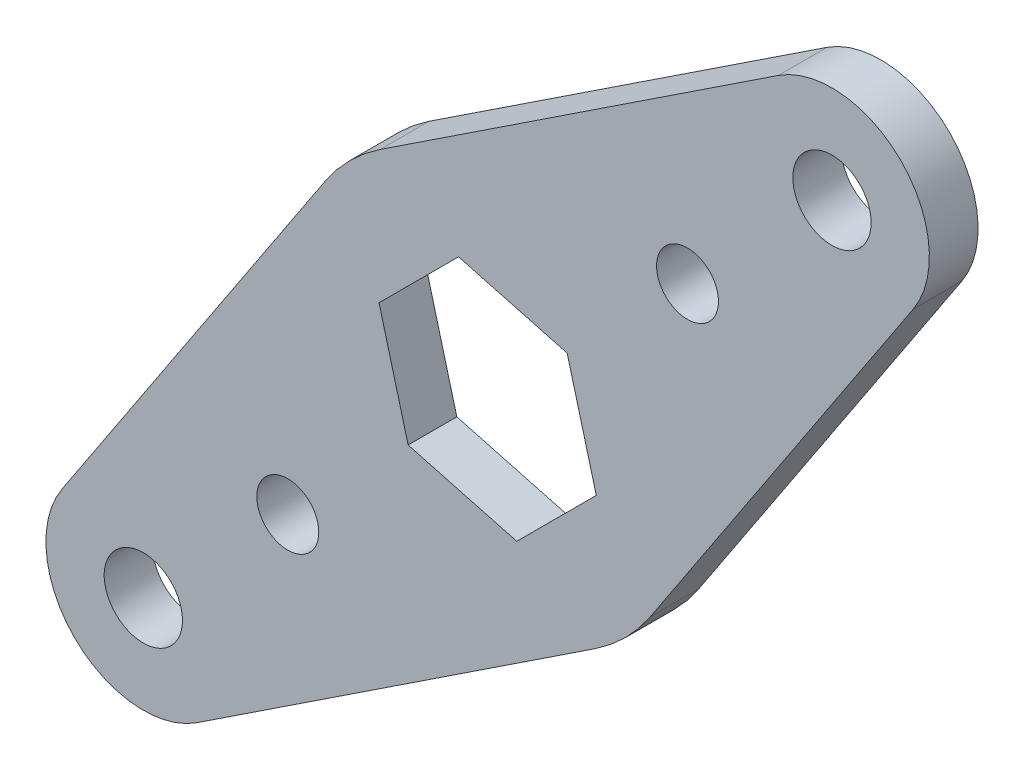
ISO-10303-21;
HEADER;
FILE_DESCRIPTION(('STEP AP214'),'2;1');
FILE_NAME('part.step','',(''),(''),'','','');
FILE_SCHEMA(('AUTOMOTIVE_DESIGN { 1 0 10303 214 1 1 1 1 }'));
ENDSEC;
DATA;
#1=APPLICATION_CONTEXT('core data for automotive mechanical design processes');
#2=APPLICATION_PROTOCOL_DEFINITION('international standard','automotive_design',2000,#1);
#3=PRODUCT_CONTEXT('',#1,'mechanical');
#4=PRODUCT('Part','Part','',(#3));
#5=PRODUCT_RELATED_PRODUCT_CATEGORY('part','',(#4));
#6=PRODUCT_DEFINITION_FORMATION('','',#4);
#7=PRODUCT_DEFINITION_CONTEXT('part definition',#1,'design');
#8=PRODUCT_DEFINITION('design','',#6,#7);
#9=PRODUCT_DEFINITION_SHAPE('','',#8);
#10=(LENGTH_UNIT() NAMED_UNIT(*) SI_UNIT(.MILLI.,.METRE.));
#11=(NAMED_UNIT(*) PLANE_ANGLE_UNIT() SI_UNIT($,.RADIAN.));
#12=(NAMED_UNIT(*) SI_UNIT($,.STERADIAN.) SOLID_ANGLE_UNIT());
#13=UNCERTAINTY_MEASURE_WITH_UNIT(LENGTH_MEASURE(1.E-05),#10,'distance_accuracy_value','');
#14=(GEOMETRIC_REPRESENTATION_CONTEXT(3) GLOBAL_UNCERTAINTY_ASSIGNED_CONTEXT((#13)) GLOBAL_UNIT_ASSIGNED_CONTEXT((#10,
#11,#12)) REPRESENTATION_CONTEXT('',''));
#15=CARTESIAN_POINT('',(0.,0.,0.));
#16=DIRECTION('',(0.,0.,1.));
#17=DIRECTION('',(1.,0.,0.));
#18=AXIS2_PLACEMENT_3D('',#15,#16,#17);
#19=CARTESIAN_POINT('',(0.,0.,3.175));
#20=DIRECTION('',(0.,0.,1.));
#21=DIRECTION('',(1.,0.,0.));
#22=AXIS2_PLACEMENT_3D('',#19,#20,#21);
#23=PLANE('',#22);
#24=CARTESIAN_POINT('',(-13.0303516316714,-13.0303516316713,3.175));
#25=DIRECTION('',(0.,0.,1.));
#26=DIRECTION('',(1.,0.,0.));
#27=AXIS2_PLACEMENT_3D('',#24,#25,#26);
#28=CIRCLE('',#27,2.0193);
#29=CARTESIAN_POINT('',(-11.0110516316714,-13.0303516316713,3.175));
#30=VERTEX_POINT('',#29);
#31=EDGE_CURVE('E191',#30,#30,#28,.T.);
#32=ORIENTED_EDGE('',*,*,#31,.F.);
#33=EDGE_LOOP('',(#32));
#34=FACE_BOUND('',#33,.T.);
#35=CARTESIAN_POINT('',(22.450640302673,22.4506403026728,3.175));
#36=DIRECTION('',(0.,0.,1.));
#37=DIRECTION('',(1.,0.,0.));
#38=AXIS2_PLACEMENT_3D('',#35,#36,#37);
#39=CIRCLE('',#38,2.5527);
#40=CARTESIAN_POINT('',(25.003340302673,22.4506403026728,3.175));
#41=VERTEX_POINT('',#40);
#42=EDGE_CURVE('E203',#41,#41,#39,.T.);
#43=ORIENTED_EDGE('',*,*,#42,.F.);
#44=EDGE_LOOP('',(#43));
#45=FACE_BOUND('',#44,.T.);
#46=CARTESIAN_POINT('',(0.,0.,3.175));
#47=DIRECTION('',(0.,0.,1.));
#48=DIRECTION('',(1.,0.,0.));
#49=AXIS2_PLACEMENT_3D('',#46,#47,#48);
#50=CIRCLE('',#49,12.7);
#51=CARTESIAN_POINT('',(7.00276687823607,-10.5948693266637,3.175));
#52=VERTEX_POINT('',#51);
#53=CARTESIAN_POINT('',(10.5948693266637,-7.00276687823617,3.175));
#54=VERTEX_POINT('',#53);
#55=EDGE_CURVE('E209',#52,#54,#50,.T.);
#56=ORIENTED_EDGE('',*,*,#55,.T.);
#57=DIRECTION('',(0.55139896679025,0.834241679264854,0.));
#58=VECTOR('',#57,1.);
#59=CARTESIAN_POINT('',(27.7480749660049,18.9492568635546,3.175));
#60=LINE('',#59,#58);
#61=CARTESIAN_POINT('',(27.7480749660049,18.9492568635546,3.175));
#62=VERTEX_POINT('',#61);
#63=EDGE_CURVE('E212',#54,#62,#60,.T.);
#64=ORIENTED_EDGE('',*,*,#63,.T.);
#65=CARTESIAN_POINT('',(22.450640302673,22.4506403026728,3.175));
#66=DIRECTION('',(0.,0.,1.));
#67=DIRECTION('',(1.,0.,0.));
#68=AXIS2_PLACEMENT_3D('',#65,#66,#67);
#69=CIRCLE('',#68,6.35);
#70=CARTESIAN_POINT('',(18.949256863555,27.7480749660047,3.175));
#71=VERTEX_POINT('',#70);
#72=EDGE_CURVE('E215',#62,#71,#69,.T.);
#73=ORIENTED_EDGE('',*,*,#72,.T.);
#74=DIRECTION('',(-0.834241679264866,-0.551398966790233,0.));
#75=VECTOR('',#74,1.);
#76=CARTESIAN_POINT('',(-7.00276687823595,10.5948693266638,3.175));
#77=LINE('',#76,#75);
#78=CARTESIAN_POINT('',(-7.00276687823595,10.5948693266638,3.175));
#79=VERTEX_POINT('',#78);
#80=EDGE_CURVE('E217',#71,#79,#77,.T.);
#81=ORIENTED_EDGE('',*,*,#80,.T.);
#82=CARTESIAN_POINT('',(0.,0.,3.175));
#83=DIRECTION('',(0.,0.,1.));
#84=DIRECTION('',(1.,0.,0.));
#85=AXIS2_PLACEMENT_3D('',#82,#83,#84);
#86=CIRCLE('',#85,12.7);
#87=CARTESIAN_POINT('',(-10.5948693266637,7.00276687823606,3.175));
#88=VERTEX_POINT('',#87);
#89=EDGE_CURVE('E219',#79,#88,#86,.T.);
#90=ORIENTED_EDGE('',*,*,#89,.T.);
#91=DIRECTION('',(-0.551398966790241,-0.83424167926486,0.));
#92=VECTOR('',#91,1.);
#93=CARTESIAN_POINT('',(-10.5948693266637,7.00276687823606,3.175));
#94=LINE('',#93,#92);
#95=CARTESIAN_POINT('',(-27.7480749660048,-18.9492568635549,3.175));
#96=VERTEX_POINT('',#95);
#97=EDGE_CURVE('E221',#88,#96,#94,.T.);
#98=ORIENTED_EDGE('',*,*,#97,.T.);
#99=CARTESIAN_POINT('',(-22.450640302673,-22.4506403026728,3.175));
#100=DIRECTION('',(0.,0.,1.));
#101=DIRECTION('',(1.,0.,0.));
#102=AXIS2_PLACEMENT_3D('',#99,#100,#101);
#103=CIRCLE('',#102,6.35);
#104=CARTESIAN_POINT('',(-18.9492568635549,-27.7480749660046,3.175));
#105=VERTEX_POINT('',#104);
#106=EDGE_CURVE('E223',#96,#105,#103,.T.);
#107=ORIENTED_EDGE('',*,*,#106,.T.);
#108=DIRECTION('',(0.83424167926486,0.551398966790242,0.));
#109=VECTOR('',#108,1.);
#110=CARTESIAN_POINT('',(-18.9492568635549,-27.7480749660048,3.175));
#111=LINE('',#110,#109);
#112=EDGE_CURVE('E225',#105,#52,#111,.T.);
#113=ORIENTED_EDGE('',*,*,#112,.T.);
#114=EDGE_LOOP('',(#56,#64,#73,#81,#90,#98,#107,#113));
#115=FACE_BOUND('',#114,.T.);
#116=CARTESIAN_POINT('',(-22.450640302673,-22.4506403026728,3.175));
#117=DIRECTION('',(0.,0.,1.));
#118=DIRECTION('',(1.,0.,0.));
#119=AXIS2_PLACEMENT_3D('',#116,#117,#118);
#120=CIRCLE('',#119,2.5527);
#121=CARTESIAN_POINT('',(-19.897940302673,-22.4506403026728,3.175));
#122=VERTEX_POINT('',#121);
#123=EDGE_CURVE('E197',#122,#122,#120,.T.);
#124=ORIENTED_EDGE('',*,*,#123,.F.);
#125=EDGE_LOOP('',(#124));
#126=FACE_BOUND('',#125,.T.);
#127=CARTESIAN_POINT('',(13.0303516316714,13.0303516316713,3.175));
#128=DIRECTION('',(0.,0.,1.));
#129=DIRECTION('',(1.,0.,0.));
#130=AXIS2_PLACEMENT_3D('',#127,#128,#129);
#131=CIRCLE('',#130,2.01930000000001);
#132=CARTESIAN_POINT('',(15.0496516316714,13.0303516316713,3.175));
#133=VERTEX_POINT('',#132);
#134=EDGE_CURVE('E185',#133,#133,#131,.T.);
#135=ORIENTED_EDGE('',*,*,#134,.F.);
#136=EDGE_LOOP('',(#135));
#137=FACE_BOUND('',#136,.T.);
#138=DIRECTION('',(0.965925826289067,-0.258819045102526,0.));
#139=VECTOR('',#138,1.);
#140=CARTESIAN_POINT('',(-5.18475328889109,-5.18475328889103,3.175));
#141=LINE('',#140,#139);
#142=CARTESIAN_POINT('',(-5.18475328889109,-5.18475328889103,3.175));
#143=VERTEX_POINT('',#142);
#144=CARTESIAN_POINT('',(1.89775141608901,-7.08250470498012,3.175));
#145=VERTEX_POINT('',#144);
#146=EDGE_CURVE('E142',#143,#145,#141,.T.);
#147=ORIENTED_EDGE('',*,*,#146,.F.);
#148=DIRECTION('',(0.258819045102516,-0.96592582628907,0.));
#149=VECTOR('',#148,1.);
#150=CARTESIAN_POINT('',(-7.0825047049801,1.89775141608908,3.175));
#151=LINE('',#150,#149);
#152=CARTESIAN_POINT('',(-7.0825047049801,1.89775141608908,3.175));
#153=VERTEX_POINT('',#152);
#154=EDGE_CURVE('E134',#153,#143,#151,.T.);
#155=ORIENTED_EDGE('',*,*,#154,.F.);
#156=DIRECTION('',(-0.707106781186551,-0.707106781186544,0.));
#157=VECTOR('',#156,1.);
#158=CARTESIAN_POINT('',(-1.89775141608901,7.08250470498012,3.175));
#159=LINE('',#158,#157);
#160=CARTESIAN_POINT('',(-1.89775141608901,7.08250470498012,3.175));
#161=VERTEX_POINT('',#160);
#162=EDGE_CURVE('E163',#161,#153,#159,.T.);
#163=ORIENTED_EDGE('',*,*,#162,.F.);
#164=DIRECTION('',(-0.965925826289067,0.258819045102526,0.));
#165=VECTOR('',#164,1.);
#166=CARTESIAN_POINT('',(5.18475328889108,5.18475328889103,3.175));
#167=LINE('',#166,#165);
#168=CARTESIAN_POINT('',(5.18475328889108,5.18475328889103,3.175));
#169=VERTEX_POINT('',#168);
#170=EDGE_CURVE('E161',#169,#161,#167,.T.);
#171=ORIENTED_EDGE('',*,*,#170,.F.);
#172=DIRECTION('',(-0.258819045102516,0.96592582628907,0.));
#173=VECTOR('',#172,1.);
#174=CARTESIAN_POINT('',(7.0825047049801,-1.89775141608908,3.175));
#175=LINE('',#174,#173);
#176=CARTESIAN_POINT('',(7.0825047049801,-1.89775141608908,3.175));
#177=VERTEX_POINT('',#176);
#178=EDGE_CURVE('E157',#177,#169,#175,.T.);
#179=ORIENTED_EDGE('',*,*,#178,.F.);
#180=DIRECTION('',(0.707106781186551,0.707106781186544,0.));
#181=VECTOR('',#180,1.);
#182=CARTESIAN_POINT('',(1.89775141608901,-7.08250470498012,3.175));
#183=LINE('',#182,#181);
#184=EDGE_CURVE('E155',#145,#177,#183,.T.);
#185=ORIENTED_EDGE('',*,*,#184,.F.);
#186=EDGE_LOOP('',(#147,#155,#163,#171,#179,#185));
#187=FACE_BOUND('',#186,.T.);
#188=ADVANCED_FACE('F33',(#34,#45,#115,#126,#137,#187),#23,.T.);
#189=CARTESIAN_POINT('',(0.,0.,0.));
#190=DIRECTION('',(0.,0.,1.));
#191=DIRECTION('',(1.,0.,0.));
#192=AXIS2_PLACEMENT_3D('',#189,#190,#191);
#193=PLANE('',#192);
#194=CARTESIAN_POINT('',(13.0303516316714,13.0303516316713,0.));
#195=DIRECTION('',(0.,0.,1.));
#196=DIRECTION('',(1.,0.,0.));
#197=AXIS2_PLACEMENT_3D('',#194,#195,#196);
#198=CIRCLE('',#197,2.01930000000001);
#199=CARTESIAN_POINT('',(15.0496516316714,13.0303516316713,0.));
#200=VERTEX_POINT('',#199);
#201=EDGE_CURVE('E150',#200,#200,#198,.T.);
#202=ORIENTED_EDGE('',*,*,#201,.T.);
#203=EDGE_LOOP('',(#202));
#204=FACE_BOUND('',#203,.T.);
#205=CARTESIAN_POINT('',(-13.0303516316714,-13.0303516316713,0.));
#206=DIRECTION('',(0.,0.,1.));
#207=DIRECTION('',(1.,0.,0.));
#208=AXIS2_PLACEMENT_3D('',#205,#206,#207);
#209=CIRCLE('',#208,2.0193);
#210=CARTESIAN_POINT('',(-11.0110516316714,-13.0303516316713,0.));
#211=VERTEX_POINT('',#210);
#212=EDGE_CURVE('E188',#211,#211,#209,.T.);
#213=ORIENTED_EDGE('',*,*,#212,.T.);
#214=EDGE_LOOP('',(#213));
#215=FACE_BOUND('',#214,.T.);
#216=CARTESIAN_POINT('',(-22.450640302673,-22.4506403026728,0.));
#217=DIRECTION('',(0.,0.,1.));
#218=DIRECTION('',(1.,0.,0.));
#219=AXIS2_PLACEMENT_3D('',#216,#217,#218);
#220=CIRCLE('',#219,2.5527);
#221=CARTESIAN_POINT('',(-19.897940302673,-22.4506403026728,0.));
#222=VERTEX_POINT('',#221);
#223=EDGE_CURVE('E194',#222,#222,#220,.T.);
#224=ORIENTED_EDGE('',*,*,#223,.T.);
#225=EDGE_LOOP('',(#224));
#226=FACE_BOUND('',#225,.T.);
#227=CARTESIAN_POINT('',(22.450640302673,22.4506403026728,0.));
#228=DIRECTION('',(0.,0.,1.));
#229=DIRECTION('',(1.,0.,0.));
#230=AXIS2_PLACEMENT_3D('',#227,#228,#229);
#231=CIRCLE('',#230,2.5527);
#232=CARTESIAN_POINT('',(25.003340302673,22.4506403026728,0.));
#233=VERTEX_POINT('',#232);
#234=EDGE_CURVE('E200',#233,#233,#231,.T.);
#235=ORIENTED_EDGE('',*,*,#234,.T.);
#236=EDGE_LOOP('',(#235));
#237=FACE_BOUND('',#236,.T.);
#238=CARTESIAN_POINT('',(0.,0.,0.));
#239=DIRECTION('',(0.,0.,1.));
#240=DIRECTION('',(1.,0.,0.));
#241=AXIS2_PLACEMENT_3D('',#238,#239,#240);
#242=CIRCLE('',#241,12.7);
#243=CARTESIAN_POINT('',(7.00276687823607,-10.5948693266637,0.));
#244=VERTEX_POINT('',#243);
#245=CARTESIAN_POINT('',(10.5948693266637,-7.00276687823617,0.));
#246=VERTEX_POINT('',#245);
#247=EDGE_CURVE('E206',#244,#246,#242,.T.);
#248=ORIENTED_EDGE('',*,*,#247,.F.);
#249=DIRECTION('',(0.83424167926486,0.551398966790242,0.));
#250=VECTOR('',#249,1.);
#251=CARTESIAN_POINT('',(-18.9492568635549,-27.7480749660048,0.));
#252=LINE('',#251,#250);
#253=CARTESIAN_POINT('',(-18.9492568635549,-27.7480749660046,0.));
#254=VERTEX_POINT('',#253);
#255=EDGE_CURVE('E213',#254,#244,#252,.T.);
#256=ORIENTED_EDGE('',*,*,#255,.F.);
#257=CARTESIAN_POINT('',(-22.450640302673,-22.4506403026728,0.));
#258=DIRECTION('',(0.,0.,1.));
#259=DIRECTION('',(1.,0.,0.));
#260=AXIS2_PLACEMENT_3D('',#257,#258,#259);
#261=CIRCLE('',#260,6.35);
#262=CARTESIAN_POINT('',(-27.7480749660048,-18.9492568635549,0.));
#263=VERTEX_POINT('',#262);
#264=EDGE_CURVE('E240',#263,#254,#261,.T.);
#265=ORIENTED_EDGE('',*,*,#264,.F.);
#266=DIRECTION('',(-0.551398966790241,-0.83424167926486,0.));
#267=VECTOR('',#266,1.);
#268=CARTESIAN_POINT('',(-10.5948693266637,7.00276687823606,0.));
#269=LINE('',#268,#267);
#270=CARTESIAN_POINT('',(-10.5948693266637,7.00276687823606,0.));
#271=VERTEX_POINT('',#270);
#272=EDGE_CURVE('E238',#271,#263,#269,.T.);
#273=ORIENTED_EDGE('',*,*,#272,.F.);
#274=CARTESIAN_POINT('',(0.,0.,0.));
#275=DIRECTION('',(0.,0.,1.));
#276=DIRECTION('',(1.,0.,0.));
#277=AXIS2_PLACEMENT_3D('',#274,#275,#276);
#278=CIRCLE('',#277,12.7);
#279=CARTESIAN_POINT('',(-7.00276687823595,10.5948693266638,0.));
#280=VERTEX_POINT('',#279);
#281=EDGE_CURVE('E236',#280,#271,#278,.T.);
#282=ORIENTED_EDGE('',*,*,#281,.F.);
#283=DIRECTION('',(-0.834241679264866,-0.551398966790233,0.));
#284=VECTOR('',#283,1.);
#285=CARTESIAN_POINT('',(-7.00276687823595,10.5948693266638,0.));
#286=LINE('',#285,#284);
#287=CARTESIAN_POINT('',(18.949256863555,27.7480749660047,0.));
#288=VERTEX_POINT('',#287);
#289=EDGE_CURVE('E234',#288,#280,#286,.T.);
#290=ORIENTED_EDGE('',*,*,#289,.F.);
#291=CARTESIAN_POINT('',(22.450640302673,22.4506403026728,0.));
#292=DIRECTION('',(0.,0.,1.));
#293=DIRECTION('',(1.,0.,0.));
#294=AXIS2_PLACEMENT_3D('',#291,#292,#293);
#295=CIRCLE('',#294,6.35);
#296=CARTESIAN_POINT('',(27.7480749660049,18.9492568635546,0.));
#297=VERTEX_POINT('',#296);
#298=EDGE_CURVE('E232',#297,#288,#295,.T.);
#299=ORIENTED_EDGE('',*,*,#298,.F.);
#300=DIRECTION('',(0.55139896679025,0.834241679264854,0.));
#301=VECTOR('',#300,1.);
#302=CARTESIAN_POINT('',(27.7480749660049,18.9492568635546,0.));
#303=LINE('',#302,#301);
#304=EDGE_CURVE('E230',#246,#297,#303,.T.);
#305=ORIENTED_EDGE('',*,*,#304,.F.);
#306=EDGE_LOOP('',(#248,#256,#265,#273,#282,#290,#299,#305));
#307=FACE_BOUND('',#306,.T.);
#308=DIRECTION('',(0.258819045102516,-0.96592582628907,0.));
#309=VECTOR('',#308,1.);
#310=CARTESIAN_POINT('',(-7.0825047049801,1.89775141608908,0.));
#311=LINE('',#310,#309);
#312=CARTESIAN_POINT('',(-7.0825047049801,1.89775141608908,0.));
#313=VERTEX_POINT('',#312);
#314=CARTESIAN_POINT('',(-5.18475328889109,-5.18475328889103,0.));
#315=VERTEX_POINT('',#314);
#316=EDGE_CURVE('E56',#313,#315,#311,.T.);
#317=ORIENTED_EDGE('',*,*,#316,.T.);
#318=DIRECTION('',(0.965925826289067,-0.258819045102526,0.));
#319=VECTOR('',#318,1.);
#320=CARTESIAN_POINT('',(-5.18475328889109,-5.18475328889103,0.));
#321=LINE('',#320,#319);
#322=CARTESIAN_POINT('',(1.89775141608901,-7.08250470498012,0.));
#323=VERTEX_POINT('',#322);
#324=EDGE_CURVE('E149',#315,#323,#321,.T.);
#325=ORIENTED_EDGE('',*,*,#324,.T.);
#326=DIRECTION('',(0.707106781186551,0.707106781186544,0.));
#327=VECTOR('',#326,1.);
#328=CARTESIAN_POINT('',(1.89775141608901,-7.08250470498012,0.));
#329=LINE('',#328,#327);
#330=CARTESIAN_POINT('',(7.0825047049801,-1.89775141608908,0.));
#331=VERTEX_POINT('',#330);
#332=EDGE_CURVE('E167',#323,#331,#329,.T.);
#333=ORIENTED_EDGE('',*,*,#332,.T.);
#334=DIRECTION('',(-0.258819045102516,0.96592582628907,0.));
#335=VECTOR('',#334,1.);
#336=CARTESIAN_POINT('',(7.0825047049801,-1.89775141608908,0.));
#337=LINE('',#336,#335);
#338=CARTESIAN_POINT('',(5.18475328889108,5.18475328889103,0.));
#339=VERTEX_POINT('',#338);
#340=EDGE_CURVE('E170',#331,#339,#337,.T.);
#341=ORIENTED_EDGE('',*,*,#340,.T.);
#342=DIRECTION('',(-0.965925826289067,0.258819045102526,0.));
#343=VECTOR('',#342,1.);
#344=CARTESIAN_POINT('',(5.18475328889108,5.18475328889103,0.));
#345=LINE('',#344,#343);
#346=CARTESIAN_POINT('',(-1.89775141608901,7.08250470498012,0.));
#347=VERTEX_POINT('',#346);
#348=EDGE_CURVE('E173',#339,#347,#345,.T.);
#349=ORIENTED_EDGE('',*,*,#348,.T.);
#350=DIRECTION('',(-0.707106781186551,-0.707106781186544,0.));
#351=VECTOR('',#350,1.);
#352=CARTESIAN_POINT('',(-1.89775141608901,7.08250470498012,0.));
#353=LINE('',#352,#351);
#354=EDGE_CURVE('E143',#347,#313,#353,.T.);
#355=ORIENTED_EDGE('',*,*,#354,.T.);
#356=EDGE_LOOP('',(#317,#325,#333,#341,#349,#355));
#357=FACE_BOUND('',#356,.T.);
#358=ADVANCED_FACE('F270',(#204,#215,#226,#237,#307,#357),#193,.F.);
#359=CARTESIAN_POINT('',(0.,0.,3.175));
#360=DIRECTION('',(0.,0.,-1.));
#361=DIRECTION('',(-1.,0.,0.));
#362=AXIS2_PLACEMENT_3D('',#359,#360,#361);
#363=CYLINDRICAL_SURFACE('',#362,12.7);
#364=ORIENTED_EDGE('',*,*,#247,.T.);
#365=DIRECTION('',(0.,0.,-1.));
#366=VECTOR('',#365,1.);
#367=CARTESIAN_POINT('',(10.5948693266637,-7.00276687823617,3.175));
#368=LINE('',#367,#366);
#369=EDGE_CURVE('E11',#54,#246,#368,.T.);
#370=ORIENTED_EDGE('',*,*,#369,.F.);
#371=ORIENTED_EDGE('',*,*,#55,.F.);
#372=DIRECTION('',(0.,0.,-1.));
#373=VECTOR('',#372,1.);
#374=CARTESIAN_POINT('',(7.00276687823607,-10.5948693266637,3.175));
#375=LINE('',#374,#373);
#376=EDGE_CURVE('E227',#52,#244,#375,.T.);
#377=ORIENTED_EDGE('',*,*,#376,.T.);
#378=EDGE_LOOP('',(#364,#370,#371,#377));
#379=FACE_BOUND('',#378,.T.);
#380=ADVANCED_FACE('F35',(#379),#363,.T.);
#381=CARTESIAN_POINT('',(27.7480749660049,18.9492568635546,3.175));
#382=DIRECTION('',(-0.834241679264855,0.55139896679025,0.));
#383=DIRECTION('',(-0.55139896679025,-0.834241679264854,0.));
#384=AXIS2_PLACEMENT_3D('',#381,#382,#383);
#385=PLANE('',#384);
#386=ORIENTED_EDGE('',*,*,#304,.T.);
#387=DIRECTION('',(0.,0.,-1.));
#388=VECTOR('',#387,1.);
#389=CARTESIAN_POINT('',(27.7480749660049,18.9492568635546,3.175));
#390=LINE('',#389,#388);
#391=EDGE_CURVE('E41',#62,#297,#390,.T.);
#392=ORIENTED_EDGE('',*,*,#391,.F.);
#393=ORIENTED_EDGE('',*,*,#63,.F.);
#394=ORIENTED_EDGE('',*,*,#369,.T.);
#395=EDGE_LOOP('',(#386,#392,#393,#394));
#396=FACE_BOUND('',#395,.T.);
#397=ADVANCED_FACE('F288',(#396),#385,.F.);
#398=CARTESIAN_POINT('',(22.450640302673,22.4506403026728,3.175));
#399=DIRECTION('',(0.,0.,-1.));
#400=DIRECTION('',(-1.,0.,0.));
#401=AXIS2_PLACEMENT_3D('',#398,#399,#400);
#402=CYLINDRICAL_SURFACE('',#401,6.35);
#403=ORIENTED_EDGE('',*,*,#298,.T.);
#404=DIRECTION('',(0.,0.,-1.));
#405=VECTOR('',#404,1.);
#406=CARTESIAN_POINT('',(18.949256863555,27.7480749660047,3.175));
#407=LINE('',#406,#405);
#408=EDGE_CURVE('E257',#71,#288,#407,.T.);
#409=ORIENTED_EDGE('',*,*,#408,.F.);
#410=ORIENTED_EDGE('',*,*,#72,.F.);
#411=ORIENTED_EDGE('',*,*,#391,.T.);
#412=EDGE_LOOP('',(#403,#409,#410,#411));
#413=FACE_BOUND('',#412,.T.);
#414=ADVANCED_FACE('F264',(#413),#402,.T.);
#415=CARTESIAN_POINT('',(-7.00276687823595,10.5948693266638,3.175));
#416=DIRECTION('',(0.551398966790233,-0.834241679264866,0.));
#417=DIRECTION('',(0.834241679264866,0.551398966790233,0.));
#418=AXIS2_PLACEMENT_3D('',#415,#416,#417);
#419=PLANE('',#418);
#420=ORIENTED_EDGE('',*,*,#289,.T.);
#421=DIRECTION('',(0.,0.,-1.));
#422=VECTOR('',#421,1.);
#423=CARTESIAN_POINT('',(-7.00276687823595,10.5948693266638,3.175));
#424=LINE('',#423,#422);
#425=EDGE_CURVE('E254',#79,#280,#424,.T.);
#426=ORIENTED_EDGE('',*,*,#425,.F.);
#427=ORIENTED_EDGE('',*,*,#80,.F.);
#428=ORIENTED_EDGE('',*,*,#408,.T.);
#429=EDGE_LOOP('',(#420,#426,#427,#428));
#430=FACE_BOUND('',#429,.T.);
#431=ADVANCED_FACE('F276',(#430),#419,.F.);
#432=CARTESIAN_POINT('',(0.,0.,3.175));
#433=DIRECTION('',(0.,0.,-1.));
#434=DIRECTION('',(-1.,0.,0.));
#435=AXIS2_PLACEMENT_3D('',#432,#433,#434);
#436=CYLINDRICAL_SURFACE('',#435,12.7);
#437=ORIENTED_EDGE('',*,*,#281,.T.);
#438=DIRECTION('',(0.,0.,-1.));
#439=VECTOR('',#438,1.);
#440=CARTESIAN_POINT('',(-10.5948693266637,7.00276687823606,3.175));
#441=LINE('',#440,#439);
#442=EDGE_CURVE('E251',#88,#271,#441,.T.);
#443=ORIENTED_EDGE('',*,*,#442,.F.);
#444=ORIENTED_EDGE('',*,*,#89,.F.);
#445=ORIENTED_EDGE('',*,*,#425,.T.);
#446=EDGE_LOOP('',(#437,#443,#444,#445));
#447=FACE_BOUND('',#446,.T.);
#448=ADVANCED_FACE('F280',(#447),#436,.T.);
#449=CARTESIAN_POINT('',(-10.5948693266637,7.00276687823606,3.175));
#450=DIRECTION('',(0.83424167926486,-0.551398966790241,0.));
#451=DIRECTION('',(0.551398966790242,0.83424167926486,0.));
#452=AXIS2_PLACEMENT_3D('',#449,#450,#451);
#453=PLANE('',#452);
#454=ORIENTED_EDGE('',*,*,#272,.T.);
#455=DIRECTION('',(0.,0.,-1.));
#456=VECTOR('',#455,1.);
#457=CARTESIAN_POINT('',(-27.7480749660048,-18.9492568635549,3.175));
#458=LINE('',#457,#456);
#459=EDGE_CURVE('E248',#96,#263,#458,.T.);
#460=ORIENTED_EDGE('',*,*,#459,.F.);
#461=ORIENTED_EDGE('',*,*,#97,.F.);
#462=ORIENTED_EDGE('',*,*,#442,.T.);
#463=EDGE_LOOP('',(#454,#460,#461,#462));
#464=FACE_BOUND('',#463,.T.);
#465=ADVANCED_FACE('F301',(#464),#453,.F.);
#466=CARTESIAN_POINT('',(-22.450640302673,-22.4506403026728,3.175));
#467=DIRECTION('',(0.,0.,-1.));
#468=DIRECTION('',(-1.,0.,0.));
#469=AXIS2_PLACEMENT_3D('',#466,#467,#468);
#470=CYLINDRICAL_SURFACE('',#469,6.35);
#471=ORIENTED_EDGE('',*,*,#264,.T.);
#472=DIRECTION('',(0.,0.,-1.));
#473=VECTOR('',#472,1.);
#474=CARTESIAN_POINT('',(-18.9492568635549,-27.7480749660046,3.175));
#475=LINE('',#474,#473);
#476=EDGE_CURVE('E245',#105,#254,#475,.T.);
#477=ORIENTED_EDGE('',*,*,#476,.F.);
#478=ORIENTED_EDGE('',*,*,#106,.F.);
#479=ORIENTED_EDGE('',*,*,#459,.T.);
#480=EDGE_LOOP('',(#471,#477,#478,#479));
#481=FACE_BOUND('',#480,.T.);
#482=ADVANCED_FACE('F299',(#481),#470,.T.);
#483=CARTESIAN_POINT('',(-18.9492568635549,-27.7480749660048,3.175));
#484=DIRECTION('',(-0.551398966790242,0.83424167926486,0.));
#485=DIRECTION('',(-0.83424167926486,-0.551398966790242,0.));
#486=AXIS2_PLACEMENT_3D('',#483,#484,#485);
#487=PLANE('',#486);
#488=ORIENTED_EDGE('',*,*,#255,.T.);
#489=ORIENTED_EDGE('',*,*,#376,.F.);
#490=ORIENTED_EDGE('',*,*,#112,.F.);
#491=ORIENTED_EDGE('',*,*,#476,.T.);
#492=EDGE_LOOP('',(#488,#489,#490,#491));
#493=FACE_BOUND('',#492,.T.);
#494=ADVANCED_FACE('F294',(#493),#487,.F.);
#495=CARTESIAN_POINT('',(22.450640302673,22.4506403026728,3.175));
#496=DIRECTION('',(0.,0.,-1.));
#497=DIRECTION('',(-1.,0.,0.));
#498=AXIS2_PLACEMENT_3D('',#495,#496,#497);
#499=CYLINDRICAL_SURFACE('',#498,2.5527);
#500=ORIENTED_EDGE('',*,*,#42,.T.);
#501=EDGE_LOOP('',(#500));
#502=FACE_BOUND('',#501,.T.);
#503=ORIENTED_EDGE('',*,*,#234,.F.);
#504=EDGE_LOOP('',(#503));
#505=FACE_BOUND('',#504,.T.);
#506=ADVANCED_FACE('F321',(#502,#505),#499,.F.);
#507=CARTESIAN_POINT('',(-22.450640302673,-22.4506403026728,3.175));
#508=DIRECTION('',(0.,0.,-1.));
#509=DIRECTION('',(-1.,0.,0.));
#510=AXIS2_PLACEMENT_3D('',#507,#508,#509);
#511=CYLINDRICAL_SURFACE('',#510,2.5527);
#512=ORIENTED_EDGE('',*,*,#123,.T.);
#513=EDGE_LOOP('',(#512));
#514=FACE_BOUND('',#513,.T.);
#515=ORIENTED_EDGE('',*,*,#223,.F.);
#516=EDGE_LOOP('',(#515));
#517=FACE_BOUND('',#516,.T.);
#518=ADVANCED_FACE('F328',(#514,#517),#511,.F.);
#519=CARTESIAN_POINT('',(-13.0303516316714,-13.0303516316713,3.175));
#520=DIRECTION('',(0.,0.,-1.));
#521=DIRECTION('',(-1.,0.,0.));
#522=AXIS2_PLACEMENT_3D('',#519,#520,#521);
#523=CYLINDRICAL_SURFACE('',#522,2.0193);
#524=ORIENTED_EDGE('',*,*,#31,.T.);
#525=EDGE_LOOP('',(#524));
#526=FACE_BOUND('',#525,.T.);
#527=ORIENTED_EDGE('',*,*,#212,.F.);
#528=EDGE_LOOP('',(#527));
#529=FACE_BOUND('',#528,.T.);
#530=ADVANCED_FACE('F333',(#526,#529),#523,.F.);
#531=CARTESIAN_POINT('',(13.0303516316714,13.0303516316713,3.175));
#532=DIRECTION('',(0.,0.,-1.));
#533=DIRECTION('',(-1.,0.,0.));
#534=AXIS2_PLACEMENT_3D('',#531,#532,#533);
#535=CYLINDRICAL_SURFACE('',#534,2.01930000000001);
#536=ORIENTED_EDGE('',*,*,#134,.T.);
#537=EDGE_LOOP('',(#536));
#538=FACE_BOUND('',#537,.T.);
#539=ORIENTED_EDGE('',*,*,#201,.F.);
#540=EDGE_LOOP('',(#539));
#541=FACE_BOUND('',#540,.T.);
#542=ADVANCED_FACE('F342',(#538,#541),#535,.F.);
#543=CARTESIAN_POINT('',(-7.0825047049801,1.89775141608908,3.175));
#544=DIRECTION('',(0.96592582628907,0.258819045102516,0.));
#545=DIRECTION('',(-0.258819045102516,0.96592582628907,0.));
#546=AXIS2_PLACEMENT_3D('',#543,#544,#545);
#547=PLANE('',#546);
#548=ORIENTED_EDGE('',*,*,#316,.F.);
#549=DIRECTION('',(0.,0.,-1.));
#550=VECTOR('',#549,1.);
#551=CARTESIAN_POINT('',(-7.0825047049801,1.89775141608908,3.175));
#552=LINE('',#551,#550);
#553=EDGE_CURVE('E138',#153,#313,#552,.T.);
#554=ORIENTED_EDGE('',*,*,#553,.F.);
#555=ORIENTED_EDGE('',*,*,#154,.T.);
#556=DIRECTION('',(0.,0.,-1.));
#557=VECTOR('',#556,1.);
#558=CARTESIAN_POINT('',(-5.18475328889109,-5.18475328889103,3.175));
#559=LINE('',#558,#557);
#560=EDGE_CURVE('E137',#143,#315,#559,.T.);
#561=ORIENTED_EDGE('',*,*,#560,.T.);
#562=EDGE_LOOP('',(#548,#554,#555,#561));
#563=FACE_BOUND('',#562,.T.);
#564=ADVANCED_FACE('F136',(#563),#547,.T.);
#565=CARTESIAN_POINT('',(-5.18475328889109,-5.18475328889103,3.175));
#566=DIRECTION('',(0.258819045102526,0.965925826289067,0.));
#567=DIRECTION('',(-0.965925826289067,0.258819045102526,0.));
#568=AXIS2_PLACEMENT_3D('',#565,#566,#567);
#569=PLANE('',#568);
#570=ORIENTED_EDGE('',*,*,#324,.F.);
#571=ORIENTED_EDGE('',*,*,#560,.F.);
#572=ORIENTED_EDGE('',*,*,#146,.T.);
#573=DIRECTION('',(0.,0.,-1.));
#574=VECTOR('',#573,1.);
#575=CARTESIAN_POINT('',(1.89775141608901,-7.08250470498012,3.175));
#576=LINE('',#575,#574);
#577=EDGE_CURVE('E151',#145,#323,#576,.T.);
#578=ORIENTED_EDGE('',*,*,#577,.T.);
#579=EDGE_LOOP('',(#570,#571,#572,#578));
#580=FACE_BOUND('',#579,.T.);
#581=ADVANCED_FACE('F146',(#580),#569,.T.);
#582=CARTESIAN_POINT('',(1.89775141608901,-7.08250470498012,3.175));
#583=DIRECTION('',(-0.707106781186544,0.707106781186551,0.));
#584=DIRECTION('',(-0.707106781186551,-0.707106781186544,0.));
#585=AXIS2_PLACEMENT_3D('',#582,#583,#584);
#586=PLANE('',#585);
#587=ORIENTED_EDGE('',*,*,#332,.F.);
#588=ORIENTED_EDGE('',*,*,#577,.F.);
#589=ORIENTED_EDGE('',*,*,#184,.T.);
#590=DIRECTION('',(0.,0.,-1.));
#591=VECTOR('',#590,1.);
#592=CARTESIAN_POINT('',(7.0825047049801,-1.89775141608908,3.175));
#593=LINE('',#592,#591);
#594=EDGE_CURVE('E182',#177,#331,#593,.T.);
#595=ORIENTED_EDGE('',*,*,#594,.T.);
#596=EDGE_LOOP('',(#587,#588,#589,#595));
#597=FACE_BOUND('',#596,.T.);
#598=ADVANCED_FACE('F354',(#597),#586,.T.);
#599=CARTESIAN_POINT('',(7.0825047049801,-1.89775141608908,3.175));
#600=DIRECTION('',(-0.965925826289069,-0.258819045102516,0.));
#601=DIRECTION('',(0.258819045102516,-0.96592582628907,0.));
#602=AXIS2_PLACEMENT_3D('',#599,#600,#601);
#603=PLANE('',#602);
#604=ORIENTED_EDGE('',*,*,#340,.F.);
#605=ORIENTED_EDGE('',*,*,#594,.F.);
#606=ORIENTED_EDGE('',*,*,#178,.T.);
#607=DIRECTION('',(0.,0.,-1.));
#608=VECTOR('',#607,1.);
#609=CARTESIAN_POINT('',(5.18475328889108,5.18475328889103,3.175));
#610=LINE('',#609,#608);
#611=EDGE_CURVE('E180',#169,#339,#610,.T.);
#612=ORIENTED_EDGE('',*,*,#611,.T.);
#613=EDGE_LOOP('',(#604,#605,#606,#612));
#614=FACE_BOUND('',#613,.T.);
#615=ADVANCED_FACE('F357',(#614),#603,.T.);
#616=CARTESIAN_POINT('',(5.18475328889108,5.18475328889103,3.175));
#617=DIRECTION('',(-0.258819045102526,-0.965925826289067,0.));
#618=DIRECTION('',(0.965925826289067,-0.258819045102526,0.));
#619=AXIS2_PLACEMENT_3D('',#616,#617,#618);
#620=PLANE('',#619);
#621=ORIENTED_EDGE('',*,*,#348,.F.);
#622=ORIENTED_EDGE('',*,*,#611,.F.);
#623=ORIENTED_EDGE('',*,*,#170,.T.);
#624=DIRECTION('',(0.,0.,-1.));
#625=VECTOR('',#624,1.);
#626=CARTESIAN_POINT('',(-1.89775141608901,7.08250470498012,3.175));
#627=LINE('',#626,#625);
#628=EDGE_CURVE('E48',#161,#347,#627,.T.);
#629=ORIENTED_EDGE('',*,*,#628,.T.);
#630=EDGE_LOOP('',(#621,#622,#623,#629));
#631=FACE_BOUND('',#630,.T.);
#632=ADVANCED_FACE('F361',(#631),#620,.T.);
#633=CARTESIAN_POINT('',(-1.89775141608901,7.08250470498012,3.175));
#634=DIRECTION('',(0.707106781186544,-0.707106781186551,0.));
#635=DIRECTION('',(0.707106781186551,0.707106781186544,0.));
#636=AXIS2_PLACEMENT_3D('',#633,#634,#635);
#637=PLANE('',#636);
#638=ORIENTED_EDGE('',*,*,#354,.F.);
#639=ORIENTED_EDGE('',*,*,#628,.F.);
#640=ORIENTED_EDGE('',*,*,#162,.T.);
#641=ORIENTED_EDGE('',*,*,#553,.T.);
#642=EDGE_LOOP('',(#638,#639,#640,#641));
#643=FACE_BOUND('',#642,.T.);
#644=ADVANCED_FACE('F365',(#643),#637,.T.);
#645=CLOSED_SHELL('',(#188,#358,#380,#397,#414,#431,#448,#465,#482,#494,#506,#518,#530,#542,
#564,#581,#598,#615,#632,#644));
#646=MANIFOLD_SOLID_BREP('B2',#645);
#647=ADVANCED_BREP_SHAPE_REPRESENTATION('',(#18,#646),#14);
#648=SHAPE_DEFINITION_REPRESENTATION(#9,#647);
ENDSEC;
END-ISO-10303-21;
